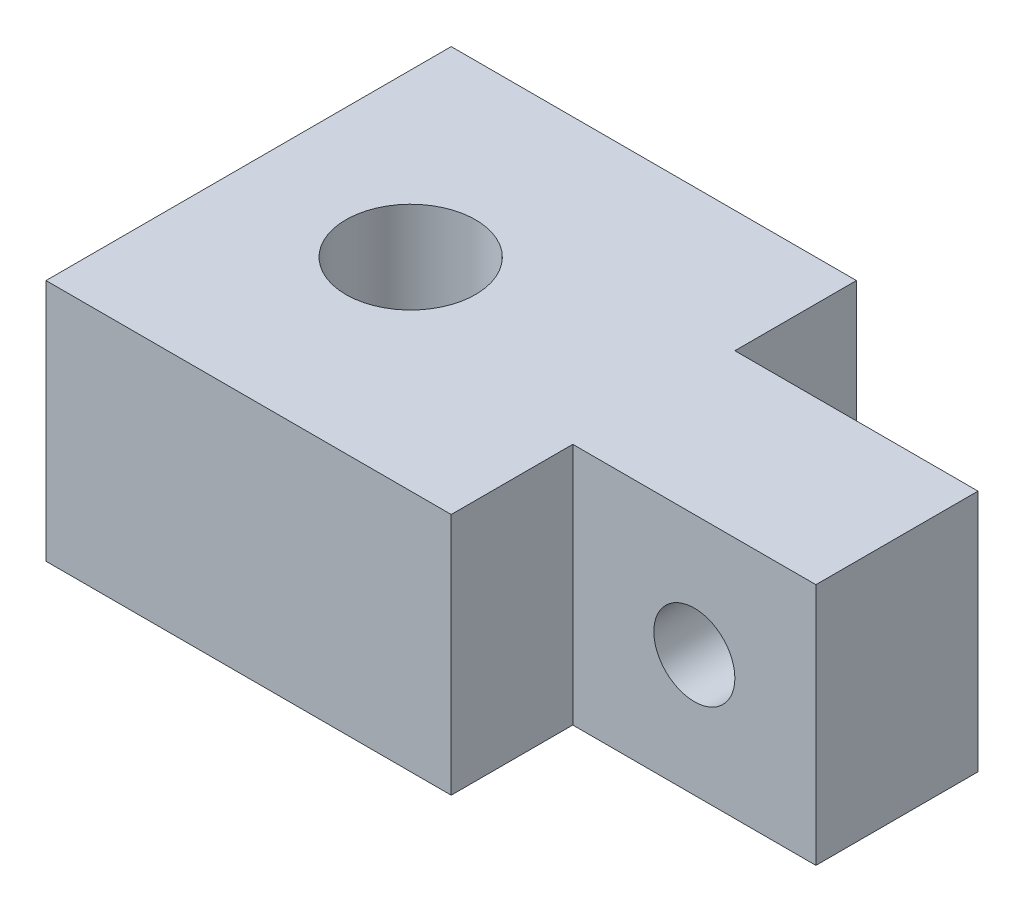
from build123d import *

# Parameters (mm, degrees)
BOSS_EXTRUDE1_DEPTH       = 3
CUT_EXTRUDE1_REACH        = 9.762
SKETCH2_R                 = 0.5
M2X0_4_TAPPED_HOLE1_D     = 1.6
M2X0_4_TAPPED_HOLE1_DEPTH = 3
M2X0_4_TAPPED_HOLE1_TIP   = 0.480688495


with BuildPart() as part:
    # Sketch1 → Boss-Extrude1 (new body)
    with BuildSketch(Plane(origin=(0, 0, 0), x_dir=(1, 0, 0), z_dir=(0, 1, 0))):
        Polygon((3.244478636, 2.906040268), (3.244478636, 1.406040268), (6.244478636, 1.406040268), (6.244478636, -0.593959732), (3.244478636, -0.593959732), (3.244478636, -2.093959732), (-1.755521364, -2.093959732), (-1.755521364, 2.906040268), align=None)
    extrude(amount=BOSS_EXTRUDE1_DEPTH)

    # Sketch2 → Cut-Extrude1 (cut, up to next)
    with BuildSketch(Plane.XY.offset(0.593959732), mode=Mode.PRIVATE) as cut_extrude1_sk1:
        with Locations((4.744478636, 1.5)):
            Circle(SKETCH2_R)
    cut_extrude1_tool1 = extrude(cut_extrude1_sk1.sketch, amount=-CUT_EXTRUDE1_REACH, mode=Mode.PRIVATE) & part.part
    add(cut_extrude1_tool1.solids().sort_by_distance((4.744479, 1.5, 0.59396))[0], mode=Mode.SUBTRACT)

    # M2x0.4 Tapped Hole1
    with Locations(Plane(origin=(0.244478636, 3, -0.406040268), x_dir=(0, 0, 1), z_dir=(0, 1, 0))):
        with Locations((0, 0)):
            Hole(M2X0_4_TAPPED_HOLE1_D / 2, depth=M2X0_4_TAPPED_HOLE1_DEPTH)
            with Locations((0, 0, -(M2X0_4_TAPPED_HOLE1_DEPTH + M2X0_4_TAPPED_HOLE1_TIP / 2))):  # 118° drill point
                Cone(0, M2X0_4_TAPPED_HOLE1_D / 2, M2X0_4_TAPPED_HOLE1_TIP, mode=Mode.SUBTRACT)


solid = part.part
